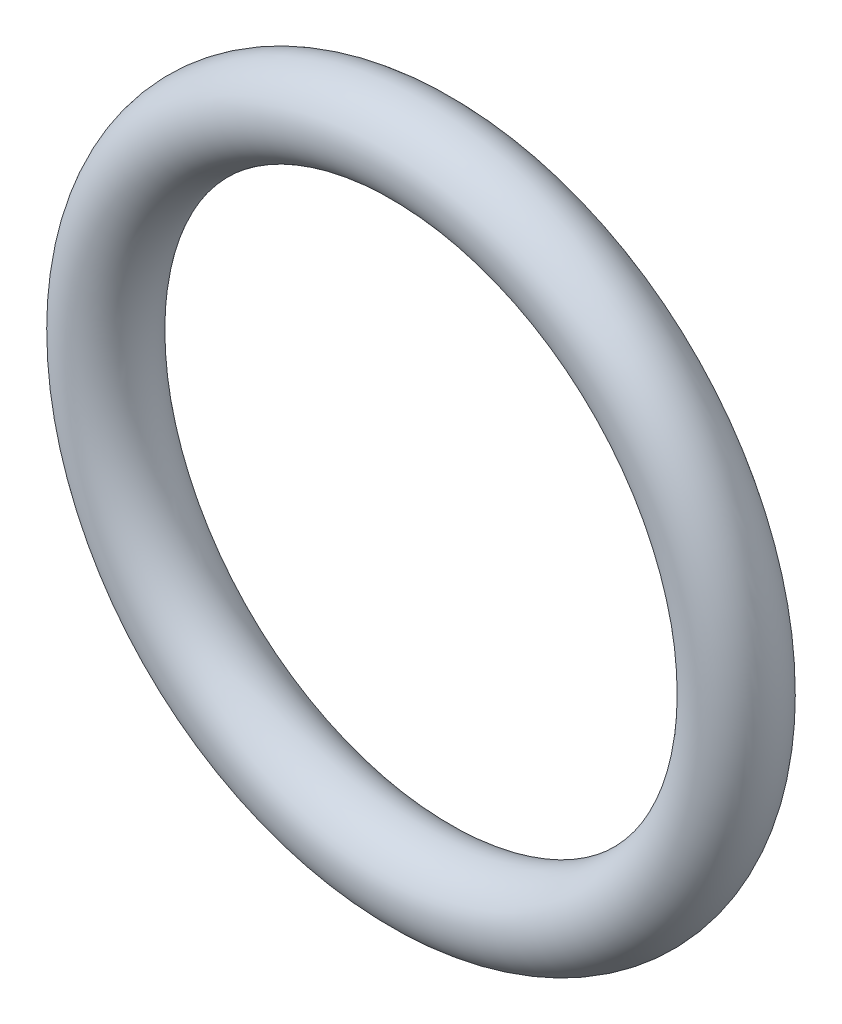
ISO-10303-21;
HEADER;
FILE_DESCRIPTION(('STEP AP214'),'2;1');
FILE_NAME('part.step','',(''),(''),'','','');
FILE_SCHEMA(('AUTOMOTIVE_DESIGN { 1 0 10303 214 1 1 1 1 }'));
ENDSEC;
DATA;
#1=APPLICATION_CONTEXT('core data for automotive mechanical design processes');
#2=APPLICATION_PROTOCOL_DEFINITION('international standard','automotive_design',2000,#1);
#3=PRODUCT_CONTEXT('',#1,'mechanical');
#4=PRODUCT('Part','Part','',(#3));
#5=PRODUCT_RELATED_PRODUCT_CATEGORY('part','',(#4));
#6=PRODUCT_DEFINITION_FORMATION('','',#4);
#7=PRODUCT_DEFINITION_CONTEXT('part definition',#1,'design');
#8=PRODUCT_DEFINITION('design','',#6,#7);
#9=PRODUCT_DEFINITION_SHAPE('','',#8);
#10=(LENGTH_UNIT() NAMED_UNIT(*) SI_UNIT(.MILLI.,.METRE.));
#11=(NAMED_UNIT(*) PLANE_ANGLE_UNIT() SI_UNIT($,.RADIAN.));
#12=(NAMED_UNIT(*) SI_UNIT($,.STERADIAN.) SOLID_ANGLE_UNIT());
#13=UNCERTAINTY_MEASURE_WITH_UNIT(LENGTH_MEASURE(1.E-05),#10,'distance_accuracy_value','');
#14=(GEOMETRIC_REPRESENTATION_CONTEXT(3) GLOBAL_UNCERTAINTY_ASSIGNED_CONTEXT((#13)) GLOBAL_UNIT_ASSIGNED_CONTEXT((#10,
#11,#12)) REPRESENTATION_CONTEXT('',''));
#15=CARTESIAN_POINT('',(0.,0.,0.));
#16=DIRECTION('',(0.,0.,1.));
#17=DIRECTION('',(1.,0.,0.));
#18=AXIS2_PLACEMENT_3D('',#15,#16,#17);
#19=CARTESIAN_POINT('',(0.,0.,0.));
#20=DIRECTION('',(0.,0.,1.));
#21=DIRECTION('',(1.,0.,0.));
#22=AXIS2_PLACEMENT_3D('',#19,#20,#21);
#23=TOROIDAL_SURFACE('',#22,9.8679,1.3081);
#24=CARTESIAN_POINT('',(11.176,0.,0.));
#25=VERTEX_POINT('',#24);
#26=VERTEX_LOOP('',#25);
#27=FACE_BOUND('',#26,.T.);
#28=ADVANCED_FACE('F33',(#27),#23,.T.);
#29=CLOSED_SHELL('',(#28));
#30=MANIFOLD_SOLID_BREP('B2',#29);
#31=ADVANCED_BREP_SHAPE_REPRESENTATION('',(#18,#30),#14);
#32=SHAPE_DEFINITION_REPRESENTATION(#9,#31);
ENDSEC;
END-ISO-10303-21;
